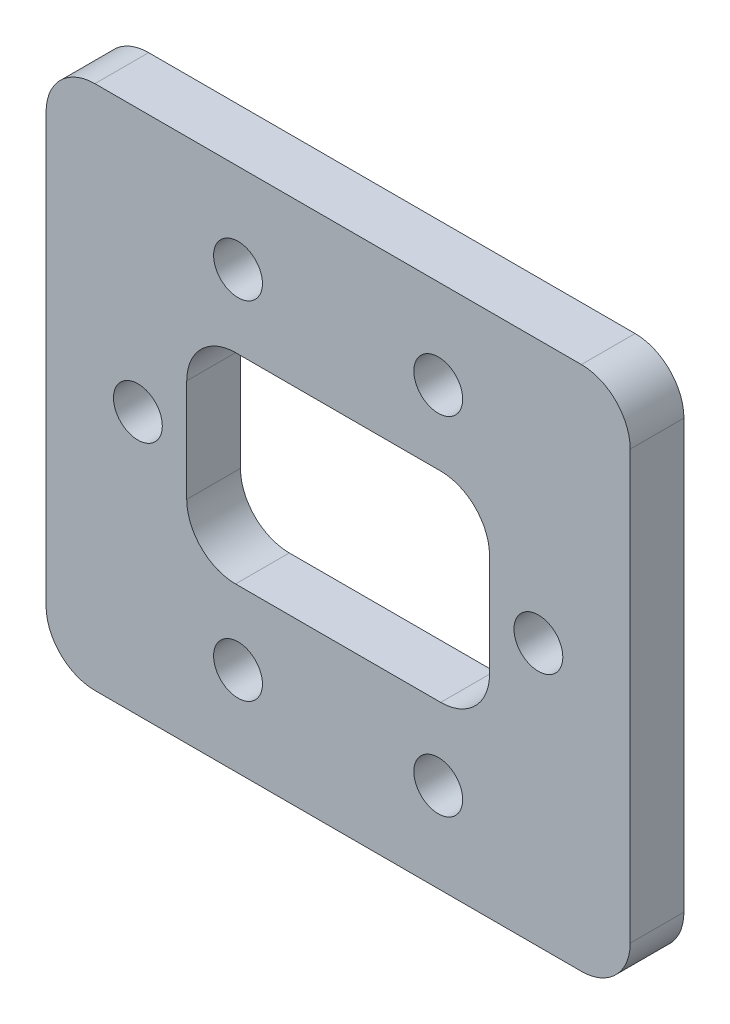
ISO-10303-21;
HEADER;
FILE_DESCRIPTION(('STEP AP214'),'2;1');
FILE_NAME('part.step','',(''),(''),'','','');
FILE_SCHEMA(('AUTOMOTIVE_DESIGN { 1 0 10303 214 1 1 1 1 }'));
ENDSEC;
DATA;
#1=APPLICATION_CONTEXT('core data for automotive mechanical design processes');
#2=APPLICATION_PROTOCOL_DEFINITION('international standard','automotive_design',2000,#1);
#3=PRODUCT_CONTEXT('',#1,'mechanical');
#4=PRODUCT('Part','Part','',(#3));
#5=PRODUCT_RELATED_PRODUCT_CATEGORY('part','',(#4));
#6=PRODUCT_DEFINITION_FORMATION('','',#4);
#7=PRODUCT_DEFINITION_CONTEXT('part definition',#1,'design');
#8=PRODUCT_DEFINITION('design','',#6,#7);
#9=PRODUCT_DEFINITION_SHAPE('','',#8);
#10=(LENGTH_UNIT() NAMED_UNIT(*) SI_UNIT(.MILLI.,.METRE.));
#11=(NAMED_UNIT(*) PLANE_ANGLE_UNIT() SI_UNIT($,.RADIAN.));
#12=(NAMED_UNIT(*) SI_UNIT($,.STERADIAN.) SOLID_ANGLE_UNIT());
#13=UNCERTAINTY_MEASURE_WITH_UNIT(LENGTH_MEASURE(1.E-05),#10,'distance_accuracy_value','');
#14=(GEOMETRIC_REPRESENTATION_CONTEXT(3) GLOBAL_UNCERTAINTY_ASSIGNED_CONTEXT((#13)) GLOBAL_UNIT_ASSIGNED_CONTEXT((#10,
#11,#12)) REPRESENTATION_CONTEXT('',''));
#15=CARTESIAN_POINT('',(0.,0.,0.));
#16=DIRECTION('',(0.,0.,1.));
#17=DIRECTION('',(1.,0.,0.));
#18=AXIS2_PLACEMENT_3D('',#15,#16,#17);
#19=CARTESIAN_POINT('',(0.,-26.1252392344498,5.5));
#20=DIRECTION('',(0.,1.,0.));
#21=DIRECTION('',(-1.,0.,0.));
#22=AXIS2_PLACEMENT_3D('',#19,#20,#21);
#23=PLANE('',#22);
#24=DIRECTION('',(0.,0.,1.));
#25=VECTOR('',#24,1.);
#26=CARTESIAN_POINT('',(-23.8778687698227,-26.1252392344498,-4.5));
#27=LINE('',#26,#25);
#28=CARTESIAN_POINT('',(-23.8778687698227,-26.1252392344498,0.));
#29=VERTEX_POINT('',#28);
#30=CARTESIAN_POINT('',(-23.8778687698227,-26.1252392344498,5.5));
#31=VERTEX_POINT('',#30);
#32=EDGE_CURVE('E196',#29,#31,#27,.T.);
#33=ORIENTED_EDGE('',*,*,#32,.F.);
#34=DIRECTION('',(1.,0.,0.));
#35=VECTOR('',#34,1.);
#36=CARTESIAN_POINT('',(0.,-26.1252392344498,0.));
#37=LINE('',#36,#35);
#38=CARTESIAN_POINT('',(25.9221312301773,-26.1252392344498,0.));
#39=VERTEX_POINT('',#38);
#40=EDGE_CURVE('E286',#29,#39,#37,.T.);
#41=ORIENTED_EDGE('',*,*,#40,.T.);
#42=DIRECTION('',(0.,0.,1.));
#43=VECTOR('',#42,1.);
#44=CARTESIAN_POINT('',(25.9221312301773,-26.1252392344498,-4.5));
#45=LINE('',#44,#43);
#46=CARTESIAN_POINT('',(25.9221312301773,-26.1252392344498,5.5));
#47=VERTEX_POINT('',#46);
#48=EDGE_CURVE('E63',#39,#47,#45,.T.);
#49=ORIENTED_EDGE('',*,*,#48,.T.);
#50=DIRECTION('',(1.,0.,0.));
#51=VECTOR('',#50,1.);
#52=CARTESIAN_POINT('',(0.,-26.1252392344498,5.5));
#53=LINE('',#52,#51);
#54=EDGE_CURVE('E223',#31,#47,#53,.T.);
#55=ORIENTED_EDGE('',*,*,#54,.F.);
#56=EDGE_LOOP('',(#33,#41,#49,#55));
#57=FACE_BOUND('',#56,.T.);
#58=ADVANCED_FACE('F47',(#57),#23,.F.);
#59=CARTESIAN_POINT('',(0.,11.0282815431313,5.5));
#60=DIRECTION('',(0.,1.,0.));
#61=DIRECTION('',(0.,0.,1.));
#62=AXIS2_PLACEMENT_3D('',#59,#60,#61);
#63=PLANE('',#62);
#64=DIRECTION('',(1.,0.,0.));
#65=VECTOR('',#64,1.);
#66=CARTESIAN_POINT('',(0.,11.0282815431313,0.));
#67=LINE('',#66,#65);
#68=CARTESIAN_POINT('',(-9.4778687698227,11.0282815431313,0.));
#69=VERTEX_POINT('',#68);
#70=CARTESIAN_POINT('',(11.5221312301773,11.0282815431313,0.));
#71=VERTEX_POINT('',#70);
#72=EDGE_CURVE('E314',#69,#71,#67,.T.);
#73=ORIENTED_EDGE('',*,*,#72,.T.);
#74=DIRECTION('',(0.,0.,-1.));
#75=VECTOR('',#74,1.);
#76=CARTESIAN_POINT('',(11.5221312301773,11.0282815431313,5.5));
#77=LINE('',#76,#75);
#78=CARTESIAN_POINT('',(11.5221312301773,11.0282815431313,5.5));
#79=VERTEX_POINT('',#78);
#80=EDGE_CURVE('E365',#79,#71,#77,.T.);
#81=ORIENTED_EDGE('',*,*,#80,.F.);
#82=DIRECTION('',(1.,0.,0.));
#83=VECTOR('',#82,1.);
#84=CARTESIAN_POINT('',(0.,11.0282815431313,5.5));
#85=LINE('',#84,#83);
#86=CARTESIAN_POINT('',(-9.4778687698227,11.0282815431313,5.5));
#87=VERTEX_POINT('',#86);
#88=EDGE_CURVE('E252',#87,#79,#85,.T.);
#89=ORIENTED_EDGE('',*,*,#88,.F.);
#90=DIRECTION('',(0.,0.,-1.));
#91=VECTOR('',#90,1.);
#92=CARTESIAN_POINT('',(-9.4778687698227,11.0282815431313,5.5));
#93=LINE('',#92,#91);
#94=EDGE_CURVE('E282',#87,#69,#93,.T.);
#95=ORIENTED_EDGE('',*,*,#94,.T.);
#96=EDGE_LOOP('',(#73,#81,#89,#95));
#97=FACE_BOUND('',#96,.T.);
#98=ADVANCED_FACE('F421',(#97),#63,.F.);
#99=CARTESIAN_POINT('',(11.5221312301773,6.02828154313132,5.5));
#100=DIRECTION('',(0.,0.,-1.));
#101=DIRECTION('',(-1.,0.,0.));
#102=AXIS2_PLACEMENT_3D('',#99,#100,#101);
#103=CYLINDRICAL_SURFACE('',#102,5.);
#104=CARTESIAN_POINT('',(11.5221312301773,6.02828154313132,0.));
#105=DIRECTION('',(0.,0.,1.));
#106=DIRECTION('',(1.,0.,0.));
#107=AXIS2_PLACEMENT_3D('',#104,#105,#106);
#108=CIRCLE('',#107,5.);
#109=CARTESIAN_POINT('',(16.5221312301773,6.02828154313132,0.));
#110=VERTEX_POINT('',#109);
#111=EDGE_CURVE('E318',#71,#110,#108,.F.);
#112=ORIENTED_EDGE('',*,*,#111,.T.);
#113=DIRECTION('',(0.,0.,-1.));
#114=VECTOR('',#113,1.);
#115=CARTESIAN_POINT('',(16.5221312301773,6.02828154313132,5.5));
#116=LINE('',#115,#114);
#117=CARTESIAN_POINT('',(16.5221312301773,6.02828154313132,5.5));
#118=VERTEX_POINT('',#117);
#119=EDGE_CURVE('E361',#118,#110,#116,.T.);
#120=ORIENTED_EDGE('',*,*,#119,.F.);
#121=CARTESIAN_POINT('',(11.5221312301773,6.02828154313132,5.5));
#122=DIRECTION('',(0.,0.,1.));
#123=DIRECTION('',(1.,0.,0.));
#124=AXIS2_PLACEMENT_3D('',#121,#122,#123);
#125=CIRCLE('',#124,5.);
#126=EDGE_CURVE('E256',#79,#118,#125,.F.);
#127=ORIENTED_EDGE('',*,*,#126,.F.);
#128=ORIENTED_EDGE('',*,*,#80,.T.);
#129=EDGE_LOOP('',(#112,#120,#127,#128));
#130=FACE_BOUND('',#129,.T.);
#131=ADVANCED_FACE('F425',(#130),#103,.F.);
#132=CARTESIAN_POINT('',(16.5221312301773,0.,5.5));
#133=DIRECTION('',(1.,0.,0.));
#134=DIRECTION('',(0.,0.,-1.));
#135=AXIS2_PLACEMENT_3D('',#132,#133,#134);
#136=PLANE('',#135);
#137=DIRECTION('',(0.,-1.,0.));
#138=VECTOR('',#137,1.);
#139=CARTESIAN_POINT('',(16.5221312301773,0.,0.));
#140=LINE('',#139,#138);
#141=CARTESIAN_POINT('',(16.5221312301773,-4.47876001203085,0.));
#142=VERTEX_POINT('',#141);
#143=EDGE_CURVE('E321',#110,#142,#140,.T.);
#144=ORIENTED_EDGE('',*,*,#143,.T.);
#145=DIRECTION('',(0.,0.,-1.));
#146=VECTOR('',#145,1.);
#147=CARTESIAN_POINT('',(16.5221312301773,-4.47876001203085,5.5));
#148=LINE('',#147,#146);
#149=CARTESIAN_POINT('',(16.5221312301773,-4.47876001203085,5.5));
#150=VERTEX_POINT('',#149);
#151=EDGE_CURVE('E358',#150,#142,#148,.T.);
#152=ORIENTED_EDGE('',*,*,#151,.F.);
#153=DIRECTION('',(0.,-1.,0.));
#154=VECTOR('',#153,1.);
#155=CARTESIAN_POINT('',(16.5221312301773,0.,5.5));
#156=LINE('',#155,#154);
#157=EDGE_CURVE('E259',#118,#150,#156,.T.);
#158=ORIENTED_EDGE('',*,*,#157,.F.);
#159=ORIENTED_EDGE('',*,*,#119,.T.);
#160=EDGE_LOOP('',(#144,#152,#158,#159));
#161=FACE_BOUND('',#160,.T.);
#162=ADVANCED_FACE('F451',(#161),#136,.F.);
#163=CARTESIAN_POINT('',(11.5221312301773,-4.47876001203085,5.5));
#164=DIRECTION('',(0.,0.,-1.));
#165=DIRECTION('',(-1.,0.,0.));
#166=AXIS2_PLACEMENT_3D('',#163,#164,#165);
#167=CYLINDRICAL_SURFACE('',#166,5.);
#168=CARTESIAN_POINT('',(11.5221312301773,-4.47876001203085,0.));
#169=DIRECTION('',(0.,0.,1.));
#170=DIRECTION('',(1.,0.,0.));
#171=AXIS2_PLACEMENT_3D('',#168,#169,#170);
#172=CIRCLE('',#171,5.);
#173=CARTESIAN_POINT('',(11.5221312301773,-9.47876001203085,0.));
#174=VERTEX_POINT('',#173);
#175=EDGE_CURVE('E325',#174,#142,#172,.T.);
#176=ORIENTED_EDGE('',*,*,#175,.F.);
#177=DIRECTION('',(0.,0.,-1.));
#178=VECTOR('',#177,1.);
#179=CARTESIAN_POINT('',(11.5221312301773,-9.47876001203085,5.5));
#180=LINE('',#179,#178);
#181=CARTESIAN_POINT('',(11.5221312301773,-9.47876001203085,5.5));
#182=VERTEX_POINT('',#181);
#183=EDGE_CURVE('E355',#182,#174,#180,.T.);
#184=ORIENTED_EDGE('',*,*,#183,.F.);
#185=CARTESIAN_POINT('',(11.5221312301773,-4.47876001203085,5.5));
#186=DIRECTION('',(0.,0.,1.));
#187=DIRECTION('',(1.,0.,0.));
#188=AXIS2_PLACEMENT_3D('',#185,#186,#187);
#189=CIRCLE('',#188,5.);
#190=EDGE_CURVE('E262',#182,#150,#189,.T.);
#191=ORIENTED_EDGE('',*,*,#190,.T.);
#192=ORIENTED_EDGE('',*,*,#151,.T.);
#193=EDGE_LOOP('',(#176,#184,#191,#192));
#194=FACE_BOUND('',#193,.T.);
#195=ADVANCED_FACE('F455',(#194),#167,.F.);
#196=CARTESIAN_POINT('',(0.,-9.47876001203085,5.5));
#197=DIRECTION('',(0.,1.,0.));
#198=DIRECTION('',(0.,0.,1.));
#199=AXIS2_PLACEMENT_3D('',#196,#197,#198);
#200=PLANE('',#199);
#201=DIRECTION('',(1.,0.,0.));
#202=VECTOR('',#201,1.);
#203=CARTESIAN_POINT('',(0.,-9.47876001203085,0.));
#204=LINE('',#203,#202);
#205=CARTESIAN_POINT('',(-9.4778687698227,-9.47876001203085,0.));
#206=VERTEX_POINT('',#205);
#207=EDGE_CURVE('E329',#206,#174,#204,.T.);
#208=ORIENTED_EDGE('',*,*,#207,.F.);
#209=DIRECTION('',(0.,0.,-1.));
#210=VECTOR('',#209,1.);
#211=CARTESIAN_POINT('',(-9.4778687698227,-9.47876001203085,5.5));
#212=LINE('',#211,#210);
#213=CARTESIAN_POINT('',(-9.4778687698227,-9.47876001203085,5.5));
#214=VERTEX_POINT('',#213);
#215=EDGE_CURVE('E352',#214,#206,#212,.T.);
#216=ORIENTED_EDGE('',*,*,#215,.F.);
#217=DIRECTION('',(1.,0.,0.));
#218=VECTOR('',#217,1.);
#219=CARTESIAN_POINT('',(0.,-9.47876001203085,5.5));
#220=LINE('',#219,#218);
#221=EDGE_CURVE('E266',#214,#182,#220,.T.);
#222=ORIENTED_EDGE('',*,*,#221,.T.);
#223=ORIENTED_EDGE('',*,*,#183,.T.);
#224=EDGE_LOOP('',(#208,#216,#222,#223));
#225=FACE_BOUND('',#224,.T.);
#226=ADVANCED_FACE('F459',(#225),#200,.T.);
#227=CARTESIAN_POINT('',(-9.4778687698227,-4.47876001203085,5.5));
#228=DIRECTION('',(0.,0.,-1.));
#229=DIRECTION('',(-1.,0.,0.));
#230=AXIS2_PLACEMENT_3D('',#227,#228,#229);
#231=CYLINDRICAL_SURFACE('',#230,5.);
#232=CARTESIAN_POINT('',(-9.4778687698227,-4.47876001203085,0.));
#233=DIRECTION('',(0.,0.,1.));
#234=DIRECTION('',(1.,0.,0.));
#235=AXIS2_PLACEMENT_3D('',#232,#233,#234);
#236=CIRCLE('',#235,5.);
#237=CARTESIAN_POINT('',(-14.4778687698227,-4.47876001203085,0.));
#238=VERTEX_POINT('',#237);
#239=EDGE_CURVE('E333',#238,#206,#236,.T.);
#240=ORIENTED_EDGE('',*,*,#239,.F.);
#241=DIRECTION('',(0.,0.,-1.));
#242=VECTOR('',#241,1.);
#243=CARTESIAN_POINT('',(-14.4778687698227,-4.47876001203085,5.5));
#244=LINE('',#243,#242);
#245=CARTESIAN_POINT('',(-14.4778687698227,-4.47876001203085,5.5));
#246=VERTEX_POINT('',#245);
#247=EDGE_CURVE('E349',#246,#238,#244,.T.);
#248=ORIENTED_EDGE('',*,*,#247,.F.);
#249=CARTESIAN_POINT('',(-9.4778687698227,-4.47876001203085,5.5));
#250=DIRECTION('',(0.,0.,1.));
#251=DIRECTION('',(1.,0.,0.));
#252=AXIS2_PLACEMENT_3D('',#249,#250,#251);
#253=CIRCLE('',#252,5.);
#254=EDGE_CURVE('E270',#246,#214,#253,.T.);
#255=ORIENTED_EDGE('',*,*,#254,.T.);
#256=ORIENTED_EDGE('',*,*,#215,.T.);
#257=EDGE_LOOP('',(#240,#248,#255,#256));
#258=FACE_BOUND('',#257,.T.);
#259=ADVANCED_FACE('F417',(#258),#231,.F.);
#260=CARTESIAN_POINT('',(-14.4778687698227,0.,5.5));
#261=DIRECTION('',(1.,0.,0.));
#262=DIRECTION('',(0.,0.,-1.));
#263=AXIS2_PLACEMENT_3D('',#260,#261,#262);
#264=PLANE('',#263);
#265=DIRECTION('',(0.,-1.,0.));
#266=VECTOR('',#265,1.);
#267=CARTESIAN_POINT('',(-14.4778687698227,0.,0.));
#268=LINE('',#267,#266);
#269=CARTESIAN_POINT('',(-14.4778687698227,6.02828154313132,0.));
#270=VERTEX_POINT('',#269);
#271=EDGE_CURVE('E337',#270,#238,#268,.T.);
#272=ORIENTED_EDGE('',*,*,#271,.F.);
#273=DIRECTION('',(0.,0.,-1.));
#274=VECTOR('',#273,1.);
#275=CARTESIAN_POINT('',(-14.4778687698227,6.02828154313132,5.5));
#276=LINE('',#275,#274);
#277=CARTESIAN_POINT('',(-14.4778687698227,6.02828154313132,5.5));
#278=VERTEX_POINT('',#277);
#279=EDGE_CURVE('E346',#278,#270,#276,.T.);
#280=ORIENTED_EDGE('',*,*,#279,.F.);
#281=DIRECTION('',(0.,-1.,0.));
#282=VECTOR('',#281,1.);
#283=CARTESIAN_POINT('',(-14.4778687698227,0.,5.5));
#284=LINE('',#283,#282);
#285=EDGE_CURVE('E274',#278,#246,#284,.T.);
#286=ORIENTED_EDGE('',*,*,#285,.T.);
#287=ORIENTED_EDGE('',*,*,#247,.T.);
#288=EDGE_LOOP('',(#272,#280,#286,#287));
#289=FACE_BOUND('',#288,.T.);
#290=ADVANCED_FACE('F409',(#289),#264,.T.);
#291=CARTESIAN_POINT('',(0.,27.6747607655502,5.5));
#292=DIRECTION('',(0.,1.,0.));
#293=DIRECTION('',(-1.,0.,0.));
#294=AXIS2_PLACEMENT_3D('',#291,#292,#293);
#295=PLANE('',#294);
#296=DIRECTION('',(0.,0.,1.));
#297=VECTOR('',#296,1.);
#298=CARTESIAN_POINT('',(-23.8778687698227,27.6747607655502,-4.5));
#299=LINE('',#298,#297);
#300=CARTESIAN_POINT('',(-23.8778687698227,27.6747607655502,0.));
#301=VERTEX_POINT('',#300);
#302=CARTESIAN_POINT('',(-23.8778687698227,27.6747607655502,5.5));
#303=VERTEX_POINT('',#302);
#304=EDGE_CURVE('E71',#301,#303,#299,.T.);
#305=ORIENTED_EDGE('',*,*,#304,.T.);
#306=DIRECTION('',(1.,0.,0.));
#307=VECTOR('',#306,1.);
#308=CARTESIAN_POINT('',(0.,27.6747607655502,5.5));
#309=LINE('',#308,#307);
#310=CARTESIAN_POINT('',(25.9221312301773,27.6747607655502,5.5));
#311=VERTEX_POINT('',#310);
#312=EDGE_CURVE('E185',#303,#311,#309,.T.);
#313=ORIENTED_EDGE('',*,*,#312,.T.);
#314=DIRECTION('',(0.,0.,1.));
#315=VECTOR('',#314,1.);
#316=CARTESIAN_POINT('',(25.9221312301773,27.6747607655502,-4.5));
#317=LINE('',#316,#315);
#318=CARTESIAN_POINT('',(25.9221312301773,27.6747607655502,0.));
#319=VERTEX_POINT('',#318);
#320=EDGE_CURVE('E214',#319,#311,#317,.T.);
#321=ORIENTED_EDGE('',*,*,#320,.F.);
#322=DIRECTION('',(1.,0.,0.));
#323=VECTOR('',#322,1.);
#324=CARTESIAN_POINT('',(0.,27.6747607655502,0.));
#325=LINE('',#324,#323);
#326=EDGE_CURVE('E195',#301,#319,#325,.T.);
#327=ORIENTED_EDGE('',*,*,#326,.F.);
#328=EDGE_LOOP('',(#305,#313,#321,#327));
#329=FACE_BOUND('',#328,.T.);
#330=ADVANCED_FACE('F49',(#329),#295,.T.);
#331=CARTESIAN_POINT('',(-19.4778687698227,0.774760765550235,5.5));
#332=DIRECTION('',(0.,0.,-1.));
#333=DIRECTION('',(-1.,0.,0.));
#334=AXIS2_PLACEMENT_3D('',#331,#332,#333);
#335=CYLINDRICAL_SURFACE('',#334,2.5);
#336=CARTESIAN_POINT('',(-19.4778687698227,0.774760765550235,5.5));
#337=DIRECTION('',(0.,0.,1.));
#338=DIRECTION('',(1.,0.,0.));
#339=AXIS2_PLACEMENT_3D('',#336,#337,#338);
#340=CIRCLE('',#339,2.5);
#341=CARTESIAN_POINT('',(-16.9778687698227,0.774760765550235,5.5));
#342=VERTEX_POINT('',#341);
#343=EDGE_CURVE('E248',#342,#342,#340,.T.);
#344=ORIENTED_EDGE('',*,*,#343,.T.);
#345=EDGE_LOOP('',(#344));
#346=FACE_BOUND('',#345,.T.);
#347=CARTESIAN_POINT('',(-19.4778687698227,0.774760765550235,0.));
#348=DIRECTION('',(0.,0.,1.));
#349=DIRECTION('',(1.,0.,0.));
#350=AXIS2_PLACEMENT_3D('',#347,#348,#349);
#351=CIRCLE('',#350,2.5);
#352=CARTESIAN_POINT('',(-16.9778687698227,0.774760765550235,0.));
#353=VERTEX_POINT('',#352);
#354=EDGE_CURVE('E310',#353,#353,#351,.T.);
#355=ORIENTED_EDGE('',*,*,#354,.F.);
#356=EDGE_LOOP('',(#355));
#357=FACE_BOUND('',#356,.T.);
#358=ADVANCED_FACE('F408',(#346,#357),#335,.F.);
#359=CARTESIAN_POINT('',(21.5221312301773,0.774760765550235,5.5));
#360=DIRECTION('',(0.,0.,-1.));
#361=DIRECTION('',(-1.,0.,0.));
#362=AXIS2_PLACEMENT_3D('',#359,#360,#361);
#363=CYLINDRICAL_SURFACE('',#362,2.5);
#364=CARTESIAN_POINT('',(21.5221312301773,0.774760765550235,5.5));
#365=DIRECTION('',(0.,0.,1.));
#366=DIRECTION('',(1.,0.,0.));
#367=AXIS2_PLACEMENT_3D('',#364,#365,#366);
#368=CIRCLE('',#367,2.5);
#369=CARTESIAN_POINT('',(24.0221312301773,0.774760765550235,5.5));
#370=VERTEX_POINT('',#369);
#371=EDGE_CURVE('E244',#370,#370,#368,.T.);
#372=ORIENTED_EDGE('',*,*,#371,.T.);
#373=EDGE_LOOP('',(#372));
#374=FACE_BOUND('',#373,.T.);
#375=CARTESIAN_POINT('',(21.5221312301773,0.774760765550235,0.));
#376=DIRECTION('',(0.,0.,1.));
#377=DIRECTION('',(1.,0.,0.));
#378=AXIS2_PLACEMENT_3D('',#375,#376,#377);
#379=CIRCLE('',#378,2.5);
#380=CARTESIAN_POINT('',(24.0221312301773,0.774760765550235,0.));
#381=VERTEX_POINT('',#380);
#382=EDGE_CURVE('E306',#381,#381,#379,.T.);
#383=ORIENTED_EDGE('',*,*,#382,.F.);
#384=EDGE_LOOP('',(#383));
#385=FACE_BOUND('',#384,.T.);
#386=ADVANCED_FACE('F414',(#374,#385),#363,.F.);
#387=CARTESIAN_POINT('',(11.2721312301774,18.5282815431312,5.5));
#388=DIRECTION('',(0.,0.,-1.));
#389=DIRECTION('',(-1.,0.,0.));
#390=AXIS2_PLACEMENT_3D('',#387,#388,#389);
#391=CYLINDRICAL_SURFACE('',#390,2.5);
#392=CARTESIAN_POINT('',(11.2721312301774,18.5282815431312,5.5));
#393=DIRECTION('',(0.,0.,1.));
#394=DIRECTION('',(1.,0.,0.));
#395=AXIS2_PLACEMENT_3D('',#392,#393,#394);
#396=CIRCLE('',#395,2.5);
#397=CARTESIAN_POINT('',(13.7721312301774,18.5282815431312,5.5));
#398=VERTEX_POINT('',#397);
#399=EDGE_CURVE('E240',#398,#398,#396,.T.);
#400=ORIENTED_EDGE('',*,*,#399,.T.);
#401=EDGE_LOOP('',(#400));
#402=FACE_BOUND('',#401,.T.);
#403=CARTESIAN_POINT('',(11.2721312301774,18.5282815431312,0.));
#404=DIRECTION('',(0.,0.,1.));
#405=DIRECTION('',(1.,0.,0.));
#406=AXIS2_PLACEMENT_3D('',#403,#404,#405);
#407=CIRCLE('',#406,2.5);
#408=CARTESIAN_POINT('',(13.7721312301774,18.5282815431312,0.));
#409=VERTEX_POINT('',#408);
#410=EDGE_CURVE('E302',#409,#409,#407,.T.);
#411=ORIENTED_EDGE('',*,*,#410,.F.);
#412=EDGE_LOOP('',(#411));
#413=FACE_BOUND('',#412,.T.);
#414=ADVANCED_FACE('F441',(#402,#413),#391,.F.);
#415=CARTESIAN_POINT('',(11.2721312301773,-16.9787600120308,5.5));
#416=DIRECTION('',(0.,0.,-1.));
#417=DIRECTION('',(-1.,0.,0.));
#418=AXIS2_PLACEMENT_3D('',#415,#416,#417);
#419=CYLINDRICAL_SURFACE('',#418,2.5);
#420=CARTESIAN_POINT('',(11.2721312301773,-16.9787600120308,5.5));
#421=DIRECTION('',(0.,0.,1.));
#422=DIRECTION('',(1.,0.,0.));
#423=AXIS2_PLACEMENT_3D('',#420,#421,#422);
#424=CIRCLE('',#423,2.5);
#425=CARTESIAN_POINT('',(13.7721312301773,-16.9787600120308,5.5));
#426=VERTEX_POINT('',#425);
#427=EDGE_CURVE('E236',#426,#426,#424,.T.);
#428=ORIENTED_EDGE('',*,*,#427,.T.);
#429=EDGE_LOOP('',(#428));
#430=FACE_BOUND('',#429,.T.);
#431=CARTESIAN_POINT('',(11.2721312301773,-16.9787600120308,0.));
#432=DIRECTION('',(0.,0.,1.));
#433=DIRECTION('',(1.,0.,0.));
#434=AXIS2_PLACEMENT_3D('',#431,#432,#433);
#435=CIRCLE('',#434,2.5);
#436=CARTESIAN_POINT('',(13.7721312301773,-16.9787600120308,0.));
#437=VERTEX_POINT('',#436);
#438=EDGE_CURVE('E298',#437,#437,#435,.T.);
#439=ORIENTED_EDGE('',*,*,#438,.F.);
#440=EDGE_LOOP('',(#439));
#441=FACE_BOUND('',#440,.T.);
#442=ADVANCED_FACE('F437',(#430,#441),#419,.F.);
#443=CARTESIAN_POINT('',(-9.22786876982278,-16.9787600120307,5.5));
#444=DIRECTION('',(0.,0.,-1.));
#445=DIRECTION('',(-1.,0.,0.));
#446=AXIS2_PLACEMENT_3D('',#443,#444,#445);
#447=CYLINDRICAL_SURFACE('',#446,2.5);
#448=CARTESIAN_POINT('',(-9.22786876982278,-16.9787600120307,5.5));
#449=DIRECTION('',(0.,0.,1.));
#450=DIRECTION('',(1.,0.,0.));
#451=AXIS2_PLACEMENT_3D('',#448,#449,#450);
#452=CIRCLE('',#451,2.5);
#453=CARTESIAN_POINT('',(-6.72786876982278,-16.9787600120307,5.5));
#454=VERTEX_POINT('',#453);
#455=EDGE_CURVE('E232',#454,#454,#452,.T.);
#456=ORIENTED_EDGE('',*,*,#455,.T.);
#457=EDGE_LOOP('',(#456));
#458=FACE_BOUND('',#457,.T.);
#459=CARTESIAN_POINT('',(-9.22786876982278,-16.9787600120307,0.));
#460=DIRECTION('',(0.,0.,1.));
#461=DIRECTION('',(1.,0.,0.));
#462=AXIS2_PLACEMENT_3D('',#459,#460,#461);
#463=CIRCLE('',#462,2.5);
#464=CARTESIAN_POINT('',(-6.72786876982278,-16.9787600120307,0.));
#465=VERTEX_POINT('',#464);
#466=EDGE_CURVE('E294',#465,#465,#463,.T.);
#467=ORIENTED_EDGE('',*,*,#466,.F.);
#468=EDGE_LOOP('',(#467));
#469=FACE_BOUND('',#468,.T.);
#470=ADVANCED_FACE('F433',(#458,#469),#447,.F.);
#471=CARTESIAN_POINT('',(-9.22786876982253,18.5282815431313,5.5));
#472=DIRECTION('',(0.,0.,-1.));
#473=DIRECTION('',(-1.,0.,0.));
#474=AXIS2_PLACEMENT_3D('',#471,#472,#473);
#475=CYLINDRICAL_SURFACE('',#474,2.5);
#476=CARTESIAN_POINT('',(-9.22786876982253,18.5282815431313,5.5));
#477=DIRECTION('',(0.,0.,1.));
#478=DIRECTION('',(1.,0.,0.));
#479=AXIS2_PLACEMENT_3D('',#476,#477,#478);
#480=CIRCLE('',#479,2.5);
#481=CARTESIAN_POINT('',(-6.72786876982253,18.5282815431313,5.5));
#482=VERTEX_POINT('',#481);
#483=EDGE_CURVE('E228',#482,#482,#480,.T.);
#484=ORIENTED_EDGE('',*,*,#483,.T.);
#485=EDGE_LOOP('',(#484));
#486=FACE_BOUND('',#485,.T.);
#487=CARTESIAN_POINT('',(-9.22786876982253,18.5282815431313,0.));
#488=DIRECTION('',(0.,0.,1.));
#489=DIRECTION('',(1.,0.,0.));
#490=AXIS2_PLACEMENT_3D('',#487,#488,#489);
#491=CIRCLE('',#490,2.5);
#492=CARTESIAN_POINT('',(-6.72786876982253,18.5282815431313,0.));
#493=VERTEX_POINT('',#492);
#494=EDGE_CURVE('E290',#493,#493,#491,.T.);
#495=ORIENTED_EDGE('',*,*,#494,.F.);
#496=EDGE_LOOP('',(#495));
#497=FACE_BOUND('',#496,.T.);
#498=ADVANCED_FACE('F429',(#486,#497),#475,.F.);
#499=CARTESIAN_POINT('',(-9.4778687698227,6.02828154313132,5.5));
#500=DIRECTION('',(0.,0.,-1.));
#501=DIRECTION('',(-1.,0.,0.));
#502=AXIS2_PLACEMENT_3D('',#499,#500,#501);
#503=CYLINDRICAL_SURFACE('',#502,5.);
#504=CARTESIAN_POINT('',(-9.4778687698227,6.02828154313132,0.));
#505=DIRECTION('',(0.,0.,1.));
#506=DIRECTION('',(1.,0.,0.));
#507=AXIS2_PLACEMENT_3D('',#504,#505,#506);
#508=CIRCLE('',#507,5.);
#509=EDGE_CURVE('E224',#69,#270,#508,.T.);
#510=ORIENTED_EDGE('',*,*,#509,.F.);
#511=ORIENTED_EDGE('',*,*,#94,.F.);
#512=CARTESIAN_POINT('',(-9.4778687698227,6.02828154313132,5.5));
#513=DIRECTION('',(0.,0.,1.));
#514=DIRECTION('',(1.,0.,0.));
#515=AXIS2_PLACEMENT_3D('',#512,#513,#514);
#516=CIRCLE('',#515,5.);
#517=EDGE_CURVE('E278',#87,#278,#516,.T.);
#518=ORIENTED_EDGE('',*,*,#517,.T.);
#519=ORIENTED_EDGE('',*,*,#279,.T.);
#520=EDGE_LOOP('',(#510,#511,#518,#519));
#521=FACE_BOUND('',#520,.T.);
#522=ADVANCED_FACE('F432',(#521),#503,.F.);
#523=CARTESIAN_POINT('',(0.,0.,5.5));
#524=DIRECTION('',(0.,0.,1.));
#525=DIRECTION('',(1.,0.,0.));
#526=AXIS2_PLACEMENT_3D('',#523,#524,#525);
#527=PLANE('',#526);
#528=DIRECTION('',(0.,-1.,0.));
#529=VECTOR('',#528,1.);
#530=CARTESIAN_POINT('',(-28.8778687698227,0.,5.5));
#531=LINE('',#530,#529);
#532=CARTESIAN_POINT('',(-28.8778687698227,22.6747607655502,5.5));
#533=VERTEX_POINT('',#532);
#534=CARTESIAN_POINT('',(-28.8778687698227,-21.1252392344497,5.5));
#535=VERTEX_POINT('',#534);
#536=EDGE_CURVE('E170',#533,#535,#531,.T.);
#537=ORIENTED_EDGE('',*,*,#536,.T.);
#538=CARTESIAN_POINT('',(-23.8778687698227,-21.1252392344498,5.5));
#539=DIRECTION('',(0.,0.,1.));
#540=DIRECTION('',(1.,0.,0.));
#541=AXIS2_PLACEMENT_3D('',#538,#539,#540);
#542=CIRCLE('',#541,5.00000000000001);
#543=EDGE_CURVE('E167',#535,#31,#542,.T.);
#544=ORIENTED_EDGE('',*,*,#543,.T.);
#545=ORIENTED_EDGE('',*,*,#54,.T.);
#546=CARTESIAN_POINT('',(25.9221312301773,-21.1252392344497,5.5));
#547=DIRECTION('',(0.,0.,1.));
#548=DIRECTION('',(1.,0.,0.));
#549=AXIS2_PLACEMENT_3D('',#546,#547,#548);
#550=CIRCLE('',#549,5.00000000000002);
#551=CARTESIAN_POINT('',(30.9221312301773,-21.1252392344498,5.5));
#552=VERTEX_POINT('',#551);
#553=EDGE_CURVE('E205',#552,#47,#550,.F.);
#554=ORIENTED_EDGE('',*,*,#553,.F.);
#555=DIRECTION('',(0.,-1.,0.));
#556=VECTOR('',#555,1.);
#557=CARTESIAN_POINT('',(30.9221312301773,0.,5.5));
#558=LINE('',#557,#556);
#559=CARTESIAN_POINT('',(30.9221312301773,22.6747607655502,5.5));
#560=VERTEX_POINT('',#559);
#561=EDGE_CURVE('E201',#560,#552,#558,.T.);
#562=ORIENTED_EDGE('',*,*,#561,.F.);
#563=CARTESIAN_POINT('',(25.9221312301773,22.6747607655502,5.5));
#564=DIRECTION('',(0.,0.,1.));
#565=DIRECTION('',(1.,0.,0.));
#566=AXIS2_PLACEMENT_3D('',#563,#564,#565);
#567=CIRCLE('',#566,5.);
#568=EDGE_CURVE('E208',#560,#311,#567,.T.);
#569=ORIENTED_EDGE('',*,*,#568,.T.);
#570=ORIENTED_EDGE('',*,*,#312,.F.);
#571=CARTESIAN_POINT('',(-23.8778687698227,22.6747607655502,5.5));
#572=DIRECTION('',(0.,0.,1.));
#573=DIRECTION('',(1.,0.,0.));
#574=AXIS2_PLACEMENT_3D('',#571,#572,#573);
#575=CIRCLE('',#574,5.00000000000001);
#576=EDGE_CURVE('E162',#533,#303,#575,.F.);
#577=ORIENTED_EDGE('',*,*,#576,.F.);
#578=EDGE_LOOP('',(#537,#544,#545,#554,#562,#569,#570,#577));
#579=FACE_BOUND('',#578,.T.);
#580=ORIENTED_EDGE('',*,*,#483,.F.);
#581=EDGE_LOOP('',(#580));
#582=FACE_BOUND('',#581,.T.);
#583=ORIENTED_EDGE('',*,*,#455,.F.);
#584=EDGE_LOOP('',(#583));
#585=FACE_BOUND('',#584,.T.);
#586=ORIENTED_EDGE('',*,*,#427,.F.);
#587=EDGE_LOOP('',(#586));
#588=FACE_BOUND('',#587,.T.);
#589=ORIENTED_EDGE('',*,*,#399,.F.);
#590=EDGE_LOOP('',(#589));
#591=FACE_BOUND('',#590,.T.);
#592=ORIENTED_EDGE('',*,*,#371,.F.);
#593=EDGE_LOOP('',(#592));
#594=FACE_BOUND('',#593,.T.);
#595=ORIENTED_EDGE('',*,*,#343,.F.);
#596=EDGE_LOOP('',(#595));
#597=FACE_BOUND('',#596,.T.);
#598=ORIENTED_EDGE('',*,*,#88,.T.);
#599=ORIENTED_EDGE('',*,*,#126,.T.);
#600=ORIENTED_EDGE('',*,*,#157,.T.);
#601=ORIENTED_EDGE('',*,*,#190,.F.);
#602=ORIENTED_EDGE('',*,*,#221,.F.);
#603=ORIENTED_EDGE('',*,*,#254,.F.);
#604=ORIENTED_EDGE('',*,*,#285,.F.);
#605=ORIENTED_EDGE('',*,*,#517,.F.);
#606=EDGE_LOOP('',(#598,#599,#600,#601,#602,#603,#604,#605));
#607=FACE_BOUND('',#606,.T.);
#608=ADVANCED_FACE('F181',(#579,#582,#585,#588,#591,#594,#597,#607),#527,.T.);
#609=CARTESIAN_POINT('',(0.,0.,0.));
#610=DIRECTION('',(0.,0.,1.));
#611=DIRECTION('',(1.,0.,0.));
#612=AXIS2_PLACEMENT_3D('',#609,#610,#611);
#613=PLANE('',#612);
#614=CARTESIAN_POINT('',(-23.8778687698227,-21.1252392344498,0.));
#615=DIRECTION('',(0.,0.,1.));
#616=DIRECTION('',(1.,0.,0.));
#617=AXIS2_PLACEMENT_3D('',#614,#615,#616);
#618=CIRCLE('',#617,5.00000000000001);
#619=CARTESIAN_POINT('',(-28.8778687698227,-21.1252392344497,0.));
#620=VERTEX_POINT('',#619);
#621=EDGE_CURVE('E11',#620,#29,#618,.T.);
#622=ORIENTED_EDGE('',*,*,#621,.F.);
#623=DIRECTION('',(0.,-1.,0.));
#624=VECTOR('',#623,1.);
#625=CARTESIAN_POINT('',(-28.8778687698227,0.,0.));
#626=LINE('',#625,#624);
#627=CARTESIAN_POINT('',(-28.8778687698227,22.6747607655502,0.));
#628=VERTEX_POINT('',#627);
#629=EDGE_CURVE('E56',#628,#620,#626,.T.);
#630=ORIENTED_EDGE('',*,*,#629,.F.);
#631=CARTESIAN_POINT('',(-23.8778687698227,22.6747607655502,0.));
#632=DIRECTION('',(0.,0.,1.));
#633=DIRECTION('',(1.,0.,0.));
#634=AXIS2_PLACEMENT_3D('',#631,#632,#633);
#635=CIRCLE('',#634,5.00000000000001);
#636=EDGE_CURVE('E163',#628,#301,#635,.F.);
#637=ORIENTED_EDGE('',*,*,#636,.T.);
#638=ORIENTED_EDGE('',*,*,#326,.T.);
#639=CARTESIAN_POINT('',(25.9221312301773,22.6747607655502,0.));
#640=DIRECTION('',(0.,0.,1.));
#641=DIRECTION('',(1.,0.,0.));
#642=AXIS2_PLACEMENT_3D('',#639,#640,#641);
#643=CIRCLE('',#642,5.);
#644=CARTESIAN_POINT('',(30.9221312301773,22.6747607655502,0.));
#645=VERTEX_POINT('',#644);
#646=EDGE_CURVE('E376',#645,#319,#643,.T.);
#647=ORIENTED_EDGE('',*,*,#646,.F.);
#648=DIRECTION('',(0.,-1.,0.));
#649=VECTOR('',#648,1.);
#650=CARTESIAN_POINT('',(30.9221312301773,0.,0.));
#651=LINE('',#650,#649);
#652=CARTESIAN_POINT('',(30.9221312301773,-21.1252392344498,0.));
#653=VERTEX_POINT('',#652);
#654=EDGE_CURVE('E372',#645,#653,#651,.T.);
#655=ORIENTED_EDGE('',*,*,#654,.T.);
#656=CARTESIAN_POINT('',(25.9221312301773,-21.1252392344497,0.));
#657=DIRECTION('',(0.,0.,1.));
#658=DIRECTION('',(1.,0.,0.));
#659=AXIS2_PLACEMENT_3D('',#656,#657,#658);
#660=CIRCLE('',#659,5.00000000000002);
#661=EDGE_CURVE('E369',#653,#39,#660,.F.);
#662=ORIENTED_EDGE('',*,*,#661,.T.);
#663=ORIENTED_EDGE('',*,*,#40,.F.);
#664=EDGE_LOOP('',(#622,#630,#637,#638,#647,#655,#662,#663));
#665=FACE_BOUND('',#664,.T.);
#666=ORIENTED_EDGE('',*,*,#494,.T.);
#667=EDGE_LOOP('',(#666));
#668=FACE_BOUND('',#667,.T.);
#669=ORIENTED_EDGE('',*,*,#466,.T.);
#670=EDGE_LOOP('',(#669));
#671=FACE_BOUND('',#670,.T.);
#672=ORIENTED_EDGE('',*,*,#438,.T.);
#673=EDGE_LOOP('',(#672));
#674=FACE_BOUND('',#673,.T.);
#675=ORIENTED_EDGE('',*,*,#410,.T.);
#676=EDGE_LOOP('',(#675));
#677=FACE_BOUND('',#676,.T.);
#678=ORIENTED_EDGE('',*,*,#382,.T.);
#679=EDGE_LOOP('',(#678));
#680=FACE_BOUND('',#679,.T.);
#681=ORIENTED_EDGE('',*,*,#354,.T.);
#682=EDGE_LOOP('',(#681));
#683=FACE_BOUND('',#682,.T.);
#684=ORIENTED_EDGE('',*,*,#72,.F.);
#685=ORIENTED_EDGE('',*,*,#509,.T.);
#686=ORIENTED_EDGE('',*,*,#271,.T.);
#687=ORIENTED_EDGE('',*,*,#239,.T.);
#688=ORIENTED_EDGE('',*,*,#207,.T.);
#689=ORIENTED_EDGE('',*,*,#175,.T.);
#690=ORIENTED_EDGE('',*,*,#143,.F.);
#691=ORIENTED_EDGE('',*,*,#111,.F.);
#692=EDGE_LOOP('',(#684,#685,#686,#687,#688,#689,#690,#691));
#693=FACE_BOUND('',#692,.T.);
#694=ADVANCED_FACE('F389',(#665,#668,#671,#674,#677,#680,#683,#693),#613,.F.);
#695=CARTESIAN_POINT('',(30.9221312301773,0.,-4.5));
#696=DIRECTION('',(-1.,0.,0.));
#697=DIRECTION('',(0.,-1.,0.));
#698=AXIS2_PLACEMENT_3D('',#695,#696,#697);
#699=PLANE('',#698);
#700=DIRECTION('',(0.,0.,1.));
#701=VECTOR('',#700,1.);
#702=CARTESIAN_POINT('',(30.9221312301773,22.6747607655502,-4.5));
#703=LINE('',#702,#701);
#704=EDGE_CURVE('E178',#645,#560,#703,.T.);
#705=ORIENTED_EDGE('',*,*,#704,.T.);
#706=ORIENTED_EDGE('',*,*,#561,.T.);
#707=DIRECTION('',(0.,0.,1.));
#708=VECTOR('',#707,1.);
#709=CARTESIAN_POINT('',(30.9221312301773,-21.1252392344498,-4.5));
#710=LINE('',#709,#708);
#711=EDGE_CURVE('E211',#653,#552,#710,.T.);
#712=ORIENTED_EDGE('',*,*,#711,.F.);
#713=ORIENTED_EDGE('',*,*,#654,.F.);
#714=EDGE_LOOP('',(#705,#706,#712,#713));
#715=FACE_BOUND('',#714,.T.);
#716=ADVANCED_FACE('F398',(#715),#699,.F.);
#717=CARTESIAN_POINT('',(25.9221312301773,22.6747607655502,-4.5));
#718=DIRECTION('',(0.,0.,1.));
#719=DIRECTION('',(1.,0.,0.));
#720=AXIS2_PLACEMENT_3D('',#717,#718,#719);
#721=CYLINDRICAL_SURFACE('',#720,5.);
#722=ORIENTED_EDGE('',*,*,#646,.T.);
#723=ORIENTED_EDGE('',*,*,#320,.T.);
#724=ORIENTED_EDGE('',*,*,#568,.F.);
#725=ORIENTED_EDGE('',*,*,#704,.F.);
#726=EDGE_LOOP('',(#722,#723,#724,#725));
#727=FACE_BOUND('',#726,.T.);
#728=ADVANCED_FACE('F403',(#727),#721,.T.);
#729=CARTESIAN_POINT('',(25.9221312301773,-21.1252392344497,-4.5));
#730=DIRECTION('',(0.,0.,1.));
#731=DIRECTION('',(1.,0.,0.));
#732=AXIS2_PLACEMENT_3D('',#729,#730,#731);
#733=CYLINDRICAL_SURFACE('',#732,5.00000000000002);
#734=ORIENTED_EDGE('',*,*,#711,.T.);
#735=ORIENTED_EDGE('',*,*,#553,.T.);
#736=ORIENTED_EDGE('',*,*,#48,.F.);
#737=ORIENTED_EDGE('',*,*,#661,.F.);
#738=EDGE_LOOP('',(#734,#735,#736,#737));
#739=FACE_BOUND('',#738,.T.);
#740=ADVANCED_FACE('F395',(#739),#733,.T.);
#741=CARTESIAN_POINT('',(-28.8778687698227,0.,-4.5));
#742=DIRECTION('',(-1.,0.,0.));
#743=DIRECTION('',(0.,0.,1.));
#744=AXIS2_PLACEMENT_3D('',#741,#742,#743);
#745=PLANE('',#744);
#746=ORIENTED_EDGE('',*,*,#629,.T.);
#747=DIRECTION('',(0.,0.,1.));
#748=VECTOR('',#747,1.);
#749=CARTESIAN_POINT('',(-28.8778687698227,-21.1252392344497,-4.5));
#750=LINE('',#749,#748);
#751=EDGE_CURVE('E173',#620,#535,#750,.T.);
#752=ORIENTED_EDGE('',*,*,#751,.T.);
#753=ORIENTED_EDGE('',*,*,#536,.F.);
#754=DIRECTION('',(0.,0.,1.));
#755=VECTOR('',#754,1.);
#756=CARTESIAN_POINT('',(-28.8778687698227,22.6747607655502,-4.5));
#757=LINE('',#756,#755);
#758=EDGE_CURVE('E158',#628,#533,#757,.T.);
#759=ORIENTED_EDGE('',*,*,#758,.F.);
#760=EDGE_LOOP('',(#746,#752,#753,#759));
#761=FACE_BOUND('',#760,.T.);
#762=ADVANCED_FACE('F171',(#761),#745,.T.);
#763=CARTESIAN_POINT('',(-23.8778687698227,-21.1252392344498,-4.5));
#764=DIRECTION('',(0.,0.,1.));
#765=DIRECTION('',(1.,0.,0.));
#766=AXIS2_PLACEMENT_3D('',#763,#764,#765);
#767=CYLINDRICAL_SURFACE('',#766,5.00000000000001);
#768=ORIENTED_EDGE('',*,*,#621,.T.);
#769=ORIENTED_EDGE('',*,*,#32,.T.);
#770=ORIENTED_EDGE('',*,*,#543,.F.);
#771=ORIENTED_EDGE('',*,*,#751,.F.);
#772=EDGE_LOOP('',(#768,#769,#770,#771));
#773=FACE_BOUND('',#772,.T.);
#774=ADVANCED_FACE('F386',(#773),#767,.T.);
#775=CARTESIAN_POINT('',(-23.8778687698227,22.6747607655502,-4.5));
#776=DIRECTION('',(0.,0.,1.));
#777=DIRECTION('',(1.,0.,0.));
#778=AXIS2_PLACEMENT_3D('',#775,#776,#777);
#779=CYLINDRICAL_SURFACE('',#778,5.00000000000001);
#780=ORIENTED_EDGE('',*,*,#758,.T.);
#781=ORIENTED_EDGE('',*,*,#576,.T.);
#782=ORIENTED_EDGE('',*,*,#304,.F.);
#783=ORIENTED_EDGE('',*,*,#636,.F.);
#784=EDGE_LOOP('',(#780,#781,#782,#783));
#785=FACE_BOUND('',#784,.T.);
#786=ADVANCED_FACE('F160',(#785),#779,.T.);
#787=CLOSED_SHELL('',(#58,#98,#131,#162,#195,#226,#259,#290,#330,#358,#386,#414,#442,#470,#498,
#522,#608,#694,#716,#728,#740,#762,#774,#786));
#788=MANIFOLD_SOLID_BREP('B2',#787);
#789=ADVANCED_BREP_SHAPE_REPRESENTATION('',(#18,#788),#14);
#790=SHAPE_DEFINITION_REPRESENTATION(#9,#789);
ENDSEC;
END-ISO-10303-21;
